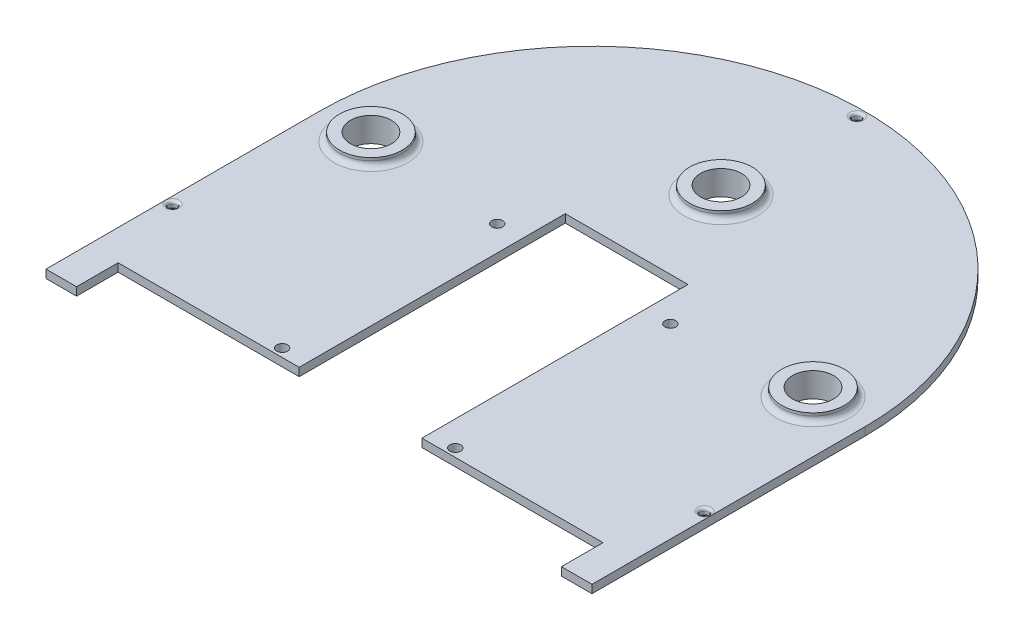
ISO-10303-21;
HEADER;
FILE_DESCRIPTION(('STEP AP214'),'2;1');
FILE_NAME('part.step','',(''),(''),'','','');
FILE_SCHEMA(('AUTOMOTIVE_DESIGN { 1 0 10303 214 1 1 1 1 }'));
ENDSEC;
DATA;
#1=APPLICATION_CONTEXT('core data for automotive mechanical design processes');
#2=APPLICATION_PROTOCOL_DEFINITION('international standard','automotive_design',2000,#1);
#3=PRODUCT_CONTEXT('',#1,'mechanical');
#4=PRODUCT('Part','Part','',(#3));
#5=PRODUCT_RELATED_PRODUCT_CATEGORY('part','',(#4));
#6=PRODUCT_DEFINITION_FORMATION('','',#4);
#7=PRODUCT_DEFINITION_CONTEXT('part definition',#1,'design');
#8=PRODUCT_DEFINITION('design','',#6,#7);
#9=PRODUCT_DEFINITION_SHAPE('','',#8);
#10=(LENGTH_UNIT() NAMED_UNIT(*) SI_UNIT(.MILLI.,.METRE.));
#11=(NAMED_UNIT(*) PLANE_ANGLE_UNIT() SI_UNIT($,.RADIAN.));
#12=(NAMED_UNIT(*) SI_UNIT($,.STERADIAN.) SOLID_ANGLE_UNIT());
#13=UNCERTAINTY_MEASURE_WITH_UNIT(LENGTH_MEASURE(1.E-05),#10,'distance_accuracy_value','');
#14=(GEOMETRIC_REPRESENTATION_CONTEXT(3) GLOBAL_UNCERTAINTY_ASSIGNED_CONTEXT((#13)) GLOBAL_UNIT_ASSIGNED_CONTEXT((#10,
#11,#12)) REPRESENTATION_CONTEXT('',''));
#15=CARTESIAN_POINT('',(0.,0.,0.));
#16=DIRECTION('',(0.,0.,1.));
#17=DIRECTION('',(1.,0.,0.));
#18=AXIS2_PLACEMENT_3D('',#15,#16,#17);
#19=CARTESIAN_POINT('',(-88.9,0.,84.86));
#20=DIRECTION('',(0.,0.,-1.));
#21=DIRECTION('',(-1.,0.,0.));
#22=AXIS2_PLACEMENT_3D('',#19,#20,#21);
#23=PLANE('',#22);
#24=DIRECTION('',(-1.,0.,0.));
#25=VECTOR('',#24,1.);
#26=CARTESIAN_POINT('',(-88.9,0.,84.86));
#27=LINE('',#26,#25);
#28=CARTESIAN_POINT('',(-22.5,0.,84.86));
#29=VERTEX_POINT('',#28);
#30=CARTESIAN_POINT('',(-88.9,0.,84.86));
#31=VERTEX_POINT('',#30);
#32=EDGE_CURVE('E249',#29,#31,#27,.T.);
#33=ORIENTED_EDGE('',*,*,#32,.F.);
#34=DIRECTION('',(0.,1.,0.));
#35=VECTOR('',#34,1.);
#36=CARTESIAN_POINT('',(-22.5,0.,84.86));
#37=LINE('',#36,#35);
#38=CARTESIAN_POINT('',(-22.5,3.,84.86));
#39=VERTEX_POINT('',#38);
#40=EDGE_CURVE('E371',#29,#39,#37,.T.);
#41=ORIENTED_EDGE('',*,*,#40,.T.);
#42=DIRECTION('',(-1.,0.,0.));
#43=VECTOR('',#42,1.);
#44=CARTESIAN_POINT('',(-88.9,3.,84.86));
#45=LINE('',#44,#43);
#46=CARTESIAN_POINT('',(-88.9,3.,84.86));
#47=VERTEX_POINT('',#46);
#48=EDGE_CURVE('E259',#39,#47,#45,.T.);
#49=ORIENTED_EDGE('',*,*,#48,.T.);
#50=DIRECTION('',(0.,1.,0.));
#51=VECTOR('',#50,1.);
#52=CARTESIAN_POINT('',(-88.9,0.,84.86));
#53=LINE('',#52,#51);
#54=EDGE_CURVE('E262',#31,#47,#53,.T.);
#55=ORIENTED_EDGE('',*,*,#54,.F.);
#56=EDGE_LOOP('',(#33,#41,#49,#55));
#57=FACE_BOUND('',#56,.T.);
#58=ADVANCED_FACE('F47',(#57),#23,.F.);
#59=CARTESIAN_POINT('',(0.,3.,100.1));
#60=DIRECTION('',(0.,0.,-1.));
#61=DIRECTION('',(-1.,0.,0.));
#62=AXIS2_PLACEMENT_3D('',#59,#60,#61);
#63=PLANE('',#62);
#64=DIRECTION('',(1.,0.,0.));
#65=VECTOR('',#64,1.);
#66=CARTESIAN_POINT('',(0.,0.,100.1));
#67=LINE('',#66,#65);
#68=CARTESIAN_POINT('',(-100.1,0.,100.1));
#69=VERTEX_POINT('',#68);
#70=CARTESIAN_POINT('',(-88.9,0.,100.1));
#71=VERTEX_POINT('',#70);
#72=EDGE_CURVE('E300',#69,#71,#67,.T.);
#73=ORIENTED_EDGE('',*,*,#72,.T.);
#74=DIRECTION('',(0.,1.,0.));
#75=VECTOR('',#74,1.);
#76=CARTESIAN_POINT('',(-88.9,0.,100.1));
#77=LINE('',#76,#75);
#78=CARTESIAN_POINT('',(-88.9,3.,100.1));
#79=VERTEX_POINT('',#78);
#80=EDGE_CURVE('E252',#71,#79,#77,.T.);
#81=ORIENTED_EDGE('',*,*,#80,.T.);
#82=DIRECTION('',(1.,0.,0.));
#83=VECTOR('',#82,1.);
#84=CARTESIAN_POINT('',(0.,3.,100.1));
#85=LINE('',#84,#83);
#86=CARTESIAN_POINT('',(-100.1,3.,100.1));
#87=VERTEX_POINT('',#86);
#88=EDGE_CURVE('E285',#87,#79,#85,.T.);
#89=ORIENTED_EDGE('',*,*,#88,.F.);
#90=DIRECTION('',(0.,-1.,0.));
#91=VECTOR('',#90,1.);
#92=CARTESIAN_POINT('',(-100.1,3.,100.1));
#93=LINE('',#92,#91);
#94=EDGE_CURVE('E313',#87,#69,#93,.T.);
#95=ORIENTED_EDGE('',*,*,#94,.T.);
#96=EDGE_LOOP('',(#73,#81,#89,#95));
#97=FACE_BOUND('',#96,.T.);
#98=ADVANCED_FACE('F489',(#97),#63,.F.);
#99=CARTESIAN_POINT('',(0.,3.,0.));
#100=DIRECTION('',(0.,-1.,0.));
#101=DIRECTION('',(0.,0.,-1.));
#102=AXIS2_PLACEMENT_3D('',#99,#100,#101);
#103=CYLINDRICAL_SURFACE('',#102,100.1);
#104=CARTESIAN_POINT('',(0.,0.,0.));
#105=DIRECTION('',(0.,1.,0.));
#106=DIRECTION('',(0.,0.,1.));
#107=AXIS2_PLACEMENT_3D('',#104,#105,#106);
#108=CIRCLE('',#107,100.1);
#109=CARTESIAN_POINT('',(100.1,0.,0.));
#110=VERTEX_POINT('',#109);
#111=CARTESIAN_POINT('',(-100.1,0.,0.));
#112=VERTEX_POINT('',#111);
#113=EDGE_CURVE('E266',#110,#112,#108,.T.);
#114=ORIENTED_EDGE('',*,*,#113,.T.);
#115=DIRECTION('',(0.,-1.,0.));
#116=VECTOR('',#115,1.);
#117=CARTESIAN_POINT('',(-100.1,3.,0.));
#118=LINE('',#117,#116);
#119=CARTESIAN_POINT('',(-100.1,3.,0.));
#120=VERTEX_POINT('',#119);
#121=EDGE_CURVE('E317',#120,#112,#118,.T.);
#122=ORIENTED_EDGE('',*,*,#121,.F.);
#123=CARTESIAN_POINT('',(0.,3.,0.));
#124=DIRECTION('',(0.,1.,0.));
#125=DIRECTION('',(0.,0.,1.));
#126=AXIS2_PLACEMENT_3D('',#123,#124,#125);
#127=CIRCLE('',#126,100.1);
#128=CARTESIAN_POINT('',(100.1,3.,0.));
#129=VERTEX_POINT('',#128);
#130=EDGE_CURVE('E276',#129,#120,#127,.T.);
#131=ORIENTED_EDGE('',*,*,#130,.F.);
#132=DIRECTION('',(0.,-1.,0.));
#133=VECTOR('',#132,1.);
#134=CARTESIAN_POINT('',(100.1,3.,0.));
#135=LINE('',#134,#133);
#136=EDGE_CURVE('E292',#129,#110,#135,.T.);
#137=ORIENTED_EDGE('',*,*,#136,.T.);
#138=EDGE_LOOP('',(#114,#122,#131,#137));
#139=FACE_BOUND('',#138,.T.);
#140=ADVANCED_FACE('F497',(#139),#103,.T.);
#141=CARTESIAN_POINT('',(-100.1,3.,0.));
#142=DIRECTION('',(1.,0.,0.));
#143=DIRECTION('',(0.,0.,-1.));
#144=AXIS2_PLACEMENT_3D('',#141,#142,#143);
#145=PLANE('',#144);
#146=DIRECTION('',(0.,0.,1.));
#147=VECTOR('',#146,1.);
#148=CARTESIAN_POINT('',(-100.1,0.,0.));
#149=LINE('',#148,#147);
#150=EDGE_CURVE('E296',#112,#69,#149,.T.);
#151=ORIENTED_EDGE('',*,*,#150,.T.);
#152=ORIENTED_EDGE('',*,*,#94,.F.);
#153=DIRECTION('',(0.,0.,1.));
#154=VECTOR('',#153,1.);
#155=CARTESIAN_POINT('',(-100.1,3.,0.));
#156=LINE('',#155,#154);
#157=EDGE_CURVE('E280',#120,#87,#156,.T.);
#158=ORIENTED_EDGE('',*,*,#157,.F.);
#159=ORIENTED_EDGE('',*,*,#121,.T.);
#160=EDGE_LOOP('',(#151,#152,#158,#159));
#161=FACE_BOUND('',#160,.T.);
#162=ADVANCED_FACE('F494',(#161),#145,.F.);
#163=CARTESIAN_POINT('',(88.9,3.,100.1));
#164=VERTEX_POINT('',#163);
#165=CARTESIAN_POINT('',(100.1,3.,100.1));
#166=VERTEX_POINT('',#165);
#167=EDGE_CURVE('E284',#164,#166,#85,.T.);
#168=ORIENTED_EDGE('',*,*,#167,.F.);
#169=DIRECTION('',(0.,1.,0.));
#170=VECTOR('',#169,1.);
#171=CARTESIAN_POINT('',(88.9,0.,100.1));
#172=LINE('',#171,#170);
#173=CARTESIAN_POINT('',(88.9,0.,100.1));
#174=VERTEX_POINT('',#173);
#175=EDGE_CURVE('E270',#174,#164,#172,.T.);
#176=ORIENTED_EDGE('',*,*,#175,.F.);
#177=CARTESIAN_POINT('',(100.1,0.,100.1));
#178=VERTEX_POINT('',#177);
#179=EDGE_CURVE('E299',#174,#178,#67,.T.);
#180=ORIENTED_EDGE('',*,*,#179,.T.);
#181=DIRECTION('',(0.,-1.,0.));
#182=VECTOR('',#181,1.);
#183=CARTESIAN_POINT('',(100.1,3.,100.1));
#184=LINE('',#183,#182);
#185=EDGE_CURVE('E309',#166,#178,#184,.T.);
#186=ORIENTED_EDGE('',*,*,#185,.F.);
#187=EDGE_LOOP('',(#168,#176,#180,#186));
#188=FACE_BOUND('',#187,.T.);
#189=ADVANCED_FACE('F474',(#188),#63,.F.);
#190=CARTESIAN_POINT('',(100.1,3.,0.));
#191=DIRECTION('',(-1.,0.,0.));
#192=DIRECTION('',(0.,0.,1.));
#193=AXIS2_PLACEMENT_3D('',#190,#191,#192);
#194=PLANE('',#193);
#195=DIRECTION('',(0.,0.,-1.));
#196=VECTOR('',#195,1.);
#197=CARTESIAN_POINT('',(100.1,0.,0.));
#198=LINE('',#197,#196);
#199=EDGE_CURVE('E281',#178,#110,#198,.T.);
#200=ORIENTED_EDGE('',*,*,#199,.T.);
#201=ORIENTED_EDGE('',*,*,#136,.F.);
#202=DIRECTION('',(0.,0.,-1.));
#203=VECTOR('',#202,1.);
#204=CARTESIAN_POINT('',(100.1,3.,0.));
#205=LINE('',#204,#203);
#206=EDGE_CURVE('E289',#166,#129,#205,.T.);
#207=ORIENTED_EDGE('',*,*,#206,.F.);
#208=ORIENTED_EDGE('',*,*,#185,.T.);
#209=EDGE_LOOP('',(#200,#201,#207,#208));
#210=FACE_BOUND('',#209,.T.);
#211=ADVANCED_FACE('F500',(#210),#194,.F.);
#212=CARTESIAN_POINT('',(0.,3.,0.));
#213=DIRECTION('',(0.,1.,0.));
#214=DIRECTION('',(0.,0.,1.));
#215=AXIS2_PLACEMENT_3D('',#212,#213,#214);
#216=PLANE('',#215);
#217=DIRECTION('',(0.,0.,1.));
#218=VECTOR('',#217,1.);
#219=CARTESIAN_POINT('',(-22.5,3.,0.));
#220=LINE('',#219,#218);
#221=CARTESIAN_POINT('',(-22.5,3.,-12.7));
#222=VERTEX_POINT('',#221);
#223=EDGE_CURVE('E145',#222,#39,#220,.T.);
#224=ORIENTED_EDGE('',*,*,#223,.F.);
#225=DIRECTION('',(-1.,0.,0.));
#226=VECTOR('',#225,1.);
#227=CARTESIAN_POINT('',(-22.5,3.,-12.7));
#228=LINE('',#227,#226);
#229=CARTESIAN_POINT('',(22.5,3.,-12.7));
#230=VERTEX_POINT('',#229);
#231=EDGE_CURVE('E152',#230,#222,#228,.T.);
#232=ORIENTED_EDGE('',*,*,#231,.F.);
#233=DIRECTION('',(0.,0.,-1.));
#234=VECTOR('',#233,1.);
#235=CARTESIAN_POINT('',(22.5,3.,0.));
#236=LINE('',#235,#234);
#237=CARTESIAN_POINT('',(22.5,3.,84.86));
#238=VERTEX_POINT('',#237);
#239=EDGE_CURVE('E135',#238,#230,#236,.T.);
#240=ORIENTED_EDGE('',*,*,#239,.F.);
#241=CARTESIAN_POINT('',(88.9,3.,84.86));
#242=VERTEX_POINT('',#241);
#243=EDGE_CURVE('E245',#242,#238,#45,.T.);
#244=ORIENTED_EDGE('',*,*,#243,.F.);
#245=DIRECTION('',(0.,0.,-1.));
#246=VECTOR('',#245,1.);
#247=CARTESIAN_POINT('',(88.9,3.,100.1));
#248=LINE('',#247,#246);
#249=EDGE_CURVE('E255',#164,#242,#248,.T.);
#250=ORIENTED_EDGE('',*,*,#249,.F.);
#251=ORIENTED_EDGE('',*,*,#167,.T.);
#252=ORIENTED_EDGE('',*,*,#206,.T.);
#253=ORIENTED_EDGE('',*,*,#130,.T.);
#254=ORIENTED_EDGE('',*,*,#157,.T.);
#255=ORIENTED_EDGE('',*,*,#88,.T.);
#256=DIRECTION('',(0.,0.,1.));
#257=VECTOR('',#256,1.);
#258=CARTESIAN_POINT('',(-88.9,3.,100.1));
#259=LINE('',#258,#257);
#260=EDGE_CURVE('E239',#47,#79,#259,.T.);
#261=ORIENTED_EDGE('',*,*,#260,.F.);
#262=ORIENTED_EDGE('',*,*,#48,.F.);
#263=EDGE_LOOP('',(#224,#232,#240,#244,#250,#251,#252,#253,#254,#255,#261,#262));
#264=FACE_BOUND('',#263,.T.);
#265=CARTESIAN_POINT('',(-97.5019237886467,3.,56.2927619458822));
#266=DIRECTION('',(0.,1.,0.));
#267=DIRECTION('',(0.,0.,1.));
#268=AXIS2_PLACEMENT_3D('',#265,#266,#267);
#269=CIRCLE('',#268,2.5);
#270=CARTESIAN_POINT('',(-97.5019237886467,3.,58.7927619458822));
#271=VERTEX_POINT('',#270);
#272=EDGE_CURVE('E417',#271,#271,#269,.F.);
#273=ORIENTED_EDGE('',*,*,#272,.T.);
#274=EDGE_LOOP('',(#273));
#275=FACE_BOUND('',#274,.T.);
#276=CARTESIAN_POINT('',(97.5019237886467,3.,56.2927619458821));
#277=DIRECTION('',(0.,1.,0.));
#278=DIRECTION('',(0.,0.,1.));
#279=AXIS2_PLACEMENT_3D('',#276,#277,#278);
#280=CIRCLE('',#279,2.5);
#281=CARTESIAN_POINT('',(97.5019237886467,3.,58.7927619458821));
#282=VERTEX_POINT('',#281);
#283=EDGE_CURVE('E413',#282,#282,#280,.F.);
#284=ORIENTED_EDGE('',*,*,#283,.T.);
#285=EDGE_LOOP('',(#284));
#286=FACE_BOUND('',#285,.T.);
#287=CARTESIAN_POINT('',(0.,3.,-97.1));
#288=DIRECTION('',(0.,1.,0.));
#289=DIRECTION('',(0.,0.,1.));
#290=AXIS2_PLACEMENT_3D('',#287,#288,#289);
#291=CIRCLE('',#290,2.5);
#292=CARTESIAN_POINT('',(0.,3.,-94.6));
#293=VERTEX_POINT('',#292);
#294=EDGE_CURVE('E409',#293,#293,#291,.F.);
#295=ORIENTED_EDGE('',*,*,#294,.T.);
#296=EDGE_LOOP('',(#295));
#297=FACE_BOUND('',#296,.T.);
#298=CARTESIAN_POINT('',(31.75,3.,81.86));
#299=DIRECTION('',(0.,1.,0.));
#300=DIRECTION('',(0.,0.,-1.));
#301=AXIS2_PLACEMENT_3D('',#298,#299,#300);
#302=CIRCLE('',#301,2.);
#303=CARTESIAN_POINT('',(31.75,3.,79.86));
#304=VERTEX_POINT('',#303);
#305=EDGE_CURVE('E164',#304,#304,#302,.T.);
#306=ORIENTED_EDGE('',*,*,#305,.F.);
#307=EDGE_LOOP('',(#306));
#308=FACE_BOUND('',#307,.T.);
#309=CARTESIAN_POINT('',(31.75,3.,3.));
#310=DIRECTION('',(0.,1.,0.));
#311=DIRECTION('',(0.,0.,-1.));
#312=AXIS2_PLACEMENT_3D('',#309,#310,#311);
#313=CIRCLE('',#312,2.);
#314=CARTESIAN_POINT('',(31.75,3.,0.999999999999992));
#315=VERTEX_POINT('',#314);
#316=EDGE_CURVE('E171',#315,#315,#313,.T.);
#317=ORIENTED_EDGE('',*,*,#316,.F.);
#318=EDGE_LOOP('',(#317));
#319=FACE_BOUND('',#318,.T.);
#320=CARTESIAN_POINT('',(-31.75,3.,2.99999999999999));
#321=DIRECTION('',(0.,1.,0.));
#322=DIRECTION('',(0.,0.,1.));
#323=AXIS2_PLACEMENT_3D('',#320,#321,#322);
#324=CIRCLE('',#323,2.);
#325=CARTESIAN_POINT('',(-31.75,3.,4.99999999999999));
#326=VERTEX_POINT('',#325);
#327=EDGE_CURVE('E166',#326,#326,#324,.T.);
#328=ORIENTED_EDGE('',*,*,#327,.F.);
#329=EDGE_LOOP('',(#328));
#330=FACE_BOUND('',#329,.T.);
#331=CARTESIAN_POINT('',(-31.75,3.,81.86));
#332=DIRECTION('',(0.,1.,0.));
#333=DIRECTION('',(0.,0.,1.));
#334=AXIS2_PLACEMENT_3D('',#331,#332,#333);
#335=CIRCLE('',#334,2.);
#336=CARTESIAN_POINT('',(-31.75,3.,83.86));
#337=VERTEX_POINT('',#336);
#338=EDGE_CURVE('E170',#337,#337,#335,.T.);
#339=ORIENTED_EDGE('',*,*,#338,.F.);
#340=EDGE_LOOP('',(#339));
#341=FACE_BOUND('',#340,.T.);
#342=CARTESIAN_POINT('',(-81.05,3.,0.));
#343=DIRECTION('',(0.,1.,0.));
#344=DIRECTION('',(0.,0.,1.));
#345=AXIS2_PLACEMENT_3D('',#342,#343,#344);
#346=CIRCLE('',#345,13.5);
#347=CARTESIAN_POINT('',(-81.05,3.,13.5));
#348=VERTEX_POINT('',#347);
#349=EDGE_CURVE('E333',#348,#348,#346,.F.);
#350=ORIENTED_EDGE('',*,*,#349,.T.);
#351=EDGE_LOOP('',(#350));
#352=FACE_BOUND('',#351,.T.);
#353=CARTESIAN_POINT('',(0.,3.,-47.3));
#354=DIRECTION('',(0.,1.,0.));
#355=DIRECTION('',(0.,0.,1.));
#356=AXIS2_PLACEMENT_3D('',#353,#354,#355);
#357=CIRCLE('',#356,13.5);
#358=CARTESIAN_POINT('',(0.,3.,-33.8));
#359=VERTEX_POINT('',#358);
#360=EDGE_CURVE('E329',#359,#359,#357,.F.);
#361=ORIENTED_EDGE('',*,*,#360,.T.);
#362=EDGE_LOOP('',(#361));
#363=FACE_BOUND('',#362,.T.);
#364=CARTESIAN_POINT('',(81.05,3.,0.));
#365=DIRECTION('',(0.,1.,0.));
#366=DIRECTION('',(0.,0.,1.));
#367=AXIS2_PLACEMENT_3D('',#364,#365,#366);
#368=CIRCLE('',#367,13.5);
#369=CARTESIAN_POINT('',(81.05,3.,13.5));
#370=VERTEX_POINT('',#369);
#371=EDGE_CURVE('E325',#370,#370,#368,.F.);
#372=ORIENTED_EDGE('',*,*,#371,.T.);
#373=EDGE_LOOP('',(#372));
#374=FACE_BOUND('',#373,.T.);
#375=ADVANCED_FACE('F156',(#264,#275,#286,#297,#308,#319,#330,#341,#352,#363,#374),#216,.T.);
#376=CARTESIAN_POINT('',(0.,0.,0.));
#377=DIRECTION('',(0.,1.,0.));
#378=DIRECTION('',(0.,0.,1.));
#379=AXIS2_PLACEMENT_3D('',#376,#377,#378);
#380=PLANE('',#379);
#381=CARTESIAN_POINT('',(-97.5019237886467,0.,56.2927619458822));
#382=DIRECTION('',(0.,1.,0.));
#383=DIRECTION('',(0.,0.,1.));
#384=AXIS2_PLACEMENT_3D('',#381,#382,#383);
#385=CIRCLE('',#384,2.5);
#386=CARTESIAN_POINT('',(-97.5019237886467,0.,58.7927619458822));
#387=VERTEX_POINT('',#386);
#388=EDGE_CURVE('E397',#387,#387,#385,.T.);
#389=ORIENTED_EDGE('',*,*,#388,.T.);
#390=EDGE_LOOP('',(#389));
#391=FACE_BOUND('',#390,.T.);
#392=CARTESIAN_POINT('',(97.5019237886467,0.,56.2927619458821));
#393=DIRECTION('',(0.,1.,0.));
#394=DIRECTION('',(0.,0.,1.));
#395=AXIS2_PLACEMENT_3D('',#392,#393,#394);
#396=CIRCLE('',#395,2.5);
#397=CARTESIAN_POINT('',(97.5019237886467,0.,58.7927619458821));
#398=VERTEX_POINT('',#397);
#399=EDGE_CURVE('E393',#398,#398,#396,.T.);
#400=ORIENTED_EDGE('',*,*,#399,.T.);
#401=EDGE_LOOP('',(#400));
#402=FACE_BOUND('',#401,.T.);
#403=CARTESIAN_POINT('',(0.,0.,-97.1));
#404=DIRECTION('',(0.,1.,0.));
#405=DIRECTION('',(0.,0.,1.));
#406=AXIS2_PLACEMENT_3D('',#403,#404,#405);
#407=CIRCLE('',#406,2.5);
#408=CARTESIAN_POINT('',(0.,0.,-94.6));
#409=VERTEX_POINT('',#408);
#410=EDGE_CURVE('E375',#409,#409,#407,.T.);
#411=ORIENTED_EDGE('',*,*,#410,.T.);
#412=EDGE_LOOP('',(#411));
#413=FACE_BOUND('',#412,.T.);
#414=CARTESIAN_POINT('',(31.75,0.,81.86));
#415=DIRECTION('',(0.,1.,0.));
#416=DIRECTION('',(0.,0.,1.));
#417=AXIS2_PLACEMENT_3D('',#414,#415,#416);
#418=CIRCLE('',#417,2.);
#419=CARTESIAN_POINT('',(31.75,0.,83.86));
#420=VERTEX_POINT('',#419);
#421=EDGE_CURVE('E183',#420,#420,#418,.T.);
#422=ORIENTED_EDGE('',*,*,#421,.T.);
#423=EDGE_LOOP('',(#422));
#424=FACE_BOUND('',#423,.T.);
#425=CARTESIAN_POINT('',(31.75,0.,3.));
#426=DIRECTION('',(0.,1.,0.));
#427=DIRECTION('',(0.,0.,1.));
#428=AXIS2_PLACEMENT_3D('',#425,#426,#427);
#429=CIRCLE('',#428,2.);
#430=CARTESIAN_POINT('',(31.75,0.,5.));
#431=VERTEX_POINT('',#430);
#432=EDGE_CURVE('E383',#431,#431,#429,.T.);
#433=ORIENTED_EDGE('',*,*,#432,.T.);
#434=EDGE_LOOP('',(#433));
#435=FACE_BOUND('',#434,.T.);
#436=CARTESIAN_POINT('',(-31.75,0.,2.99999999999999));
#437=DIRECTION('',(0.,1.,0.));
#438=DIRECTION('',(0.,0.,1.));
#439=AXIS2_PLACEMENT_3D('',#436,#437,#438);
#440=CIRCLE('',#439,2.);
#441=CARTESIAN_POINT('',(-31.75,0.,4.99999999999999));
#442=VERTEX_POINT('',#441);
#443=EDGE_CURVE('E379',#442,#442,#440,.T.);
#444=ORIENTED_EDGE('',*,*,#443,.T.);
#445=EDGE_LOOP('',(#444));
#446=FACE_BOUND('',#445,.T.);
#447=CARTESIAN_POINT('',(-31.75,0.,81.86));
#448=DIRECTION('',(0.,1.,0.));
#449=DIRECTION('',(0.,0.,1.));
#450=AXIS2_PLACEMENT_3D('',#447,#448,#449);
#451=CIRCLE('',#450,2.);
#452=CARTESIAN_POINT('',(-31.75,0.,83.86));
#453=VERTEX_POINT('',#452);
#454=EDGE_CURVE('E181',#453,#453,#451,.T.);
#455=ORIENTED_EDGE('',*,*,#454,.T.);
#456=EDGE_LOOP('',(#455));
#457=FACE_BOUND('',#456,.T.);
#458=CARTESIAN_POINT('',(81.05,0.,0.));
#459=DIRECTION('',(0.,1.,0.));
#460=DIRECTION('',(0.,0.,1.));
#461=AXIS2_PLACEMENT_3D('',#458,#459,#460);
#462=CIRCLE('',#461,13.5);
#463=CARTESIAN_POINT('',(81.05,0.,13.5));
#464=VERTEX_POINT('',#463);
#465=EDGE_CURVE('E353',#464,#464,#462,.T.);
#466=ORIENTED_EDGE('',*,*,#465,.T.);
#467=EDGE_LOOP('',(#466));
#468=FACE_BOUND('',#467,.T.);
#469=CARTESIAN_POINT('',(0.,0.,-47.3));
#470=DIRECTION('',(0.,1.,0.));
#471=DIRECTION('',(0.,0.,1.));
#472=AXIS2_PLACEMENT_3D('',#469,#470,#471);
#473=CIRCLE('',#472,13.5);
#474=CARTESIAN_POINT('',(0.,0.,-33.8));
#475=VERTEX_POINT('',#474);
#476=EDGE_CURVE('E349',#475,#475,#473,.T.);
#477=ORIENTED_EDGE('',*,*,#476,.T.);
#478=EDGE_LOOP('',(#477));
#479=FACE_BOUND('',#478,.T.);
#480=CARTESIAN_POINT('',(-81.05,0.,0.));
#481=DIRECTION('',(0.,1.,0.));
#482=DIRECTION('',(0.,0.,1.));
#483=AXIS2_PLACEMENT_3D('',#480,#481,#482);
#484=CIRCLE('',#483,13.5);
#485=CARTESIAN_POINT('',(-81.05,0.,13.5));
#486=VERTEX_POINT('',#485);
#487=EDGE_CURVE('E345',#486,#486,#484,.T.);
#488=ORIENTED_EDGE('',*,*,#487,.T.);
#489=EDGE_LOOP('',(#488));
#490=FACE_BOUND('',#489,.T.);
#491=DIRECTION('',(-1.,0.,0.));
#492=VECTOR('',#491,1.);
#493=CARTESIAN_POINT('',(0.,0.,-12.7));
#494=LINE('',#493,#492);
#495=CARTESIAN_POINT('',(22.5,0.,-12.7));
#496=VERTEX_POINT('',#495);
#497=CARTESIAN_POINT('',(-22.5,0.,-12.7));
#498=VERTEX_POINT('',#497);
#499=EDGE_CURVE('E11',#496,#498,#494,.T.);
#500=ORIENTED_EDGE('',*,*,#499,.T.);
#501=DIRECTION('',(0.,0.,1.));
#502=VECTOR('',#501,1.);
#503=CARTESIAN_POINT('',(-22.5,0.,0.));
#504=LINE('',#503,#502);
#505=EDGE_CURVE('E187',#498,#29,#504,.T.);
#506=ORIENTED_EDGE('',*,*,#505,.T.);
#507=ORIENTED_EDGE('',*,*,#32,.T.);
#508=DIRECTION('',(0.,0.,1.));
#509=VECTOR('',#508,1.);
#510=CARTESIAN_POINT('',(-88.9,0.,100.1));
#511=LINE('',#510,#509);
#512=EDGE_CURVE('E240',#31,#71,#511,.T.);
#513=ORIENTED_EDGE('',*,*,#512,.T.);
#514=ORIENTED_EDGE('',*,*,#72,.F.);
#515=ORIENTED_EDGE('',*,*,#150,.F.);
#516=ORIENTED_EDGE('',*,*,#113,.F.);
#517=ORIENTED_EDGE('',*,*,#199,.F.);
#518=ORIENTED_EDGE('',*,*,#179,.F.);
#519=DIRECTION('',(0.,0.,-1.));
#520=VECTOR('',#519,1.);
#521=CARTESIAN_POINT('',(88.9,0.,100.1));
#522=LINE('',#521,#520);
#523=CARTESIAN_POINT('',(88.9,0.,84.86));
#524=VERTEX_POINT('',#523);
#525=EDGE_CURVE('E244',#174,#524,#522,.T.);
#526=ORIENTED_EDGE('',*,*,#525,.T.);
#527=CARTESIAN_POINT('',(22.5,0.,84.86));
#528=VERTEX_POINT('',#527);
#529=EDGE_CURVE('E70',#524,#528,#27,.T.);
#530=ORIENTED_EDGE('',*,*,#529,.T.);
#531=DIRECTION('',(0.,0.,-1.));
#532=VECTOR('',#531,1.);
#533=CARTESIAN_POINT('',(22.5,0.,0.));
#534=LINE('',#533,#532);
#535=EDGE_CURVE('E63',#528,#496,#534,.T.);
#536=ORIENTED_EDGE('',*,*,#535,.T.);
#537=EDGE_LOOP('',(#500,#506,#507,#513,#514,#515,#516,#517,#518,#526,#530,#536));
#538=FACE_BOUND('',#537,.T.);
#539=ADVANCED_FACE('F445',(#391,#402,#413,#424,#435,#446,#457,#468,#479,#490,#538),#380,.F.);
#540=CARTESIAN_POINT('',(-88.9,0.,100.1));
#541=DIRECTION('',(-1.,0.,0.));
#542=DIRECTION('',(0.,0.,1.));
#543=AXIS2_PLACEMENT_3D('',#540,#541,#542);
#544=PLANE('',#543);
#545=ORIENTED_EDGE('',*,*,#260,.T.);
#546=ORIENTED_EDGE('',*,*,#80,.F.);
#547=ORIENTED_EDGE('',*,*,#512,.F.);
#548=ORIENTED_EDGE('',*,*,#54,.T.);
#549=EDGE_LOOP('',(#545,#546,#547,#548));
#550=FACE_BOUND('',#549,.T.);
#551=ADVANCED_FACE('F448',(#550),#544,.F.);
#552=ORIENTED_EDGE('',*,*,#243,.T.);
#553=DIRECTION('',(0.,-1.,0.));
#554=VECTOR('',#553,1.);
#555=CARTESIAN_POINT('',(22.5,0.,84.86));
#556=LINE('',#555,#554);
#557=EDGE_CURVE('E139',#238,#528,#556,.T.);
#558=ORIENTED_EDGE('',*,*,#557,.T.);
#559=ORIENTED_EDGE('',*,*,#529,.F.);
#560=DIRECTION('',(0.,1.,0.));
#561=VECTOR('',#560,1.);
#562=CARTESIAN_POINT('',(88.9,0.,84.86));
#563=LINE('',#562,#561);
#564=EDGE_CURVE('E267',#524,#242,#563,.T.);
#565=ORIENTED_EDGE('',*,*,#564,.T.);
#566=EDGE_LOOP('',(#552,#558,#559,#565));
#567=FACE_BOUND('',#566,.T.);
#568=ADVANCED_FACE('F513',(#567),#23,.F.);
#569=CARTESIAN_POINT('',(88.9,0.,100.1));
#570=DIRECTION('',(1.,0.,0.));
#571=DIRECTION('',(0.,0.,-1.));
#572=AXIS2_PLACEMENT_3D('',#569,#570,#571);
#573=PLANE('',#572);
#574=ORIENTED_EDGE('',*,*,#249,.T.);
#575=ORIENTED_EDGE('',*,*,#564,.F.);
#576=ORIENTED_EDGE('',*,*,#525,.F.);
#577=ORIENTED_EDGE('',*,*,#175,.T.);
#578=EDGE_LOOP('',(#574,#575,#576,#577));
#579=FACE_BOUND('',#578,.T.);
#580=ADVANCED_FACE('F470',(#579),#573,.F.);
#581=CARTESIAN_POINT('',(0.,-3.,-47.3));
#582=DIRECTION('',(0.,1.,0.));
#583=DIRECTION('',(0.,0.,1.));
#584=AXIS2_PLACEMENT_3D('',#581,#582,#583);
#585=CYLINDRICAL_SURFACE('',#584,11.5);
#586=CARTESIAN_POINT('',(0.,-2.,-47.3));
#587=DIRECTION('',(0.,1.,0.));
#588=DIRECTION('',(0.,0.,1.));
#589=AXIS2_PLACEMENT_3D('',#586,#587,#588);
#590=CIRCLE('',#589,11.5);
#591=CARTESIAN_POINT('',(0.,-2.,-35.8));
#592=VERTEX_POINT('',#591);
#593=EDGE_CURVE('E361',#592,#592,#590,.F.);
#594=ORIENTED_EDGE('',*,*,#593,.T.);
#595=EDGE_LOOP('',(#594));
#596=FACE_BOUND('',#595,.T.);
#597=CARTESIAN_POINT('',(0.,-3.,-47.3));
#598=DIRECTION('',(0.,1.,0.));
#599=DIRECTION('',(0.,0.,1.));
#600=AXIS2_PLACEMENT_3D('',#597,#598,#599);
#601=CIRCLE('',#600,11.5);
#602=CARTESIAN_POINT('',(0.,-3.,-35.8));
#603=VERTEX_POINT('',#602);
#604=EDGE_CURVE('E235',#603,#603,#601,.T.);
#605=ORIENTED_EDGE('',*,*,#604,.T.);
#606=EDGE_LOOP('',(#605));
#607=FACE_BOUND('',#606,.T.);
#608=ADVANCED_FACE('F524',(#596,#607),#585,.T.);
#609=CARTESIAN_POINT('',(0.,-3.,-47.3));
#610=DIRECTION('',(0.,1.,0.));
#611=DIRECTION('',(0.,0.,1.));
#612=AXIS2_PLACEMENT_3D('',#609,#610,#611);
#613=PLANE('',#612);
#614=CARTESIAN_POINT('',(0.,-3.,-47.3));
#615=DIRECTION('',(0.,1.,0.));
#616=DIRECTION('',(0.,0.,1.));
#617=AXIS2_PLACEMENT_3D('',#614,#615,#616);
#618=CIRCLE('',#617,7.5);
#619=CARTESIAN_POINT('',(0.,-3.,-39.8));
#620=VERTEX_POINT('',#619);
#621=EDGE_CURVE('E231',#620,#620,#618,.T.);
#622=ORIENTED_EDGE('',*,*,#621,.T.);
#623=EDGE_LOOP('',(#622));
#624=FACE_BOUND('',#623,.T.);
#625=ORIENTED_EDGE('',*,*,#604,.F.);
#626=EDGE_LOOP('',(#625));
#627=FACE_BOUND('',#626,.T.);
#628=ADVANCED_FACE('F542',(#624,#627),#613,.F.);
#629=CARTESIAN_POINT('',(0.,0.,-47.3));
#630=DIRECTION('',(0.,1.,0.));
#631=DIRECTION('',(0.,0.,1.));
#632=AXIS2_PLACEMENT_3D('',#629,#630,#631);
#633=CYLINDRICAL_SURFACE('',#632,7.5);
#634=ORIENTED_EDGE('',*,*,#621,.F.);
#635=EDGE_LOOP('',(#634));
#636=FACE_BOUND('',#635,.T.);
#637=CARTESIAN_POINT('',(0.,6.,-47.3));
#638=DIRECTION('',(0.,1.,0.));
#639=DIRECTION('',(0.,0.,1.));
#640=AXIS2_PLACEMENT_3D('',#637,#638,#639);
#641=CIRCLE('',#640,7.5);
#642=CARTESIAN_POINT('',(0.,6.,-39.8));
#643=VERTEX_POINT('',#642);
#644=EDGE_CURVE('E223',#643,#643,#641,.T.);
#645=ORIENTED_EDGE('',*,*,#644,.T.);
#646=EDGE_LOOP('',(#645));
#647=FACE_BOUND('',#646,.T.);
#648=ADVANCED_FACE('F546',(#636,#647),#633,.F.);
#649=CARTESIAN_POINT('',(0.,5.,-47.3));
#650=DIRECTION('',(0.,1.,0.));
#651=DIRECTION('',(0.,0.,1.));
#652=AXIS2_PLACEMENT_3D('',#649,#650,#651);
#653=CIRCLE('',#652,11.5);
#654=CARTESIAN_POINT('',(0.,5.,-35.8));
#655=VERTEX_POINT('',#654);
#656=EDGE_CURVE('E337',#655,#655,#653,.T.);
#657=ORIENTED_EDGE('',*,*,#656,.T.);
#658=EDGE_LOOP('',(#657));
#659=FACE_BOUND('',#658,.T.);
#660=CARTESIAN_POINT('',(0.,6.,-47.3));
#661=DIRECTION('',(0.,1.,0.));
#662=DIRECTION('',(0.,0.,1.));
#663=AXIS2_PLACEMENT_3D('',#660,#661,#662);
#664=CIRCLE('',#663,11.5);
#665=CARTESIAN_POINT('',(0.,6.,-35.8));
#666=VERTEX_POINT('',#665);
#667=EDGE_CURVE('E227',#666,#666,#664,.T.);
#668=ORIENTED_EDGE('',*,*,#667,.F.);
#669=EDGE_LOOP('',(#668));
#670=FACE_BOUND('',#669,.T.);
#671=ADVANCED_FACE('F556',(#659,#670),#585,.T.);
#672=CARTESIAN_POINT('',(0.,6.,-47.3));
#673=DIRECTION('',(0.,1.,0.));
#674=DIRECTION('',(0.,0.,1.));
#675=AXIS2_PLACEMENT_3D('',#672,#673,#674);
#676=PLANE('',#675);
#677=ORIENTED_EDGE('',*,*,#667,.T.);
#678=EDGE_LOOP('',(#677));
#679=FACE_BOUND('',#678,.T.);
#680=ORIENTED_EDGE('',*,*,#644,.F.);
#681=EDGE_LOOP('',(#680));
#682=FACE_BOUND('',#681,.T.);
#683=ADVANCED_FACE('F561',(#679,#682),#676,.T.);
#684=CARTESIAN_POINT('',(81.05,-3.,0.));
#685=DIRECTION('',(0.,1.,0.));
#686=DIRECTION('',(0.,0.,1.));
#687=AXIS2_PLACEMENT_3D('',#684,#685,#686);
#688=CYLINDRICAL_SURFACE('',#687,11.5);
#689=CARTESIAN_POINT('',(81.05,-2.,0.));
#690=DIRECTION('',(0.,1.,0.));
#691=DIRECTION('',(0.,0.,1.));
#692=AXIS2_PLACEMENT_3D('',#689,#690,#691);
#693=CIRCLE('',#692,11.5);
#694=CARTESIAN_POINT('',(81.05,-2.,11.5));
#695=VERTEX_POINT('',#694);
#696=EDGE_CURVE('E357',#695,#695,#693,.F.);
#697=ORIENTED_EDGE('',*,*,#696,.T.);
#698=EDGE_LOOP('',(#697));
#699=FACE_BOUND('',#698,.T.);
#700=CARTESIAN_POINT('',(81.05,-3.,0.));
#701=DIRECTION('',(0.,1.,0.));
#702=DIRECTION('',(0.,0.,1.));
#703=AXIS2_PLACEMENT_3D('',#700,#701,#702);
#704=CIRCLE('',#703,11.5);
#705=CARTESIAN_POINT('',(81.05,-3.,11.5));
#706=VERTEX_POINT('',#705);
#707=EDGE_CURVE('E207',#706,#706,#704,.T.);
#708=ORIENTED_EDGE('',*,*,#707,.T.);
#709=EDGE_LOOP('',(#708));
#710=FACE_BOUND('',#709,.T.);
#711=ADVANCED_FACE('F565',(#699,#710),#688,.T.);
#712=CARTESIAN_POINT('',(81.05,-3.,0.));
#713=DIRECTION('',(0.,1.,0.));
#714=DIRECTION('',(0.,0.,1.));
#715=AXIS2_PLACEMENT_3D('',#712,#713,#714);
#716=PLANE('',#715);
#717=CARTESIAN_POINT('',(81.05,-3.,0.));
#718=DIRECTION('',(0.,1.,0.));
#719=DIRECTION('',(0.,0.,1.));
#720=AXIS2_PLACEMENT_3D('',#717,#718,#719);
#721=CIRCLE('',#720,7.5);
#722=CARTESIAN_POINT('',(81.05,-3.,7.5));
#723=VERTEX_POINT('',#722);
#724=EDGE_CURVE('E211',#723,#723,#721,.T.);
#725=ORIENTED_EDGE('',*,*,#724,.T.);
#726=EDGE_LOOP('',(#725));
#727=FACE_BOUND('',#726,.T.);
#728=ORIENTED_EDGE('',*,*,#707,.F.);
#729=EDGE_LOOP('',(#728));
#730=FACE_BOUND('',#729,.T.);
#731=ADVANCED_FACE('F572',(#727,#730),#716,.F.);
#732=CARTESIAN_POINT('',(81.05,0.,0.));
#733=DIRECTION('',(0.,1.,0.));
#734=DIRECTION('',(0.,0.,1.));
#735=AXIS2_PLACEMENT_3D('',#732,#733,#734);
#736=CYLINDRICAL_SURFACE('',#735,7.5);
#737=ORIENTED_EDGE('',*,*,#724,.F.);
#738=EDGE_LOOP('',(#737));
#739=FACE_BOUND('',#738,.T.);
#740=CARTESIAN_POINT('',(81.05,6.,0.));
#741=DIRECTION('',(0.,1.,0.));
#742=DIRECTION('',(0.,0.,1.));
#743=AXIS2_PLACEMENT_3D('',#740,#741,#742);
#744=CIRCLE('',#743,7.5);
#745=CARTESIAN_POINT('',(81.05,6.,7.5));
#746=VERTEX_POINT('',#745);
#747=EDGE_CURVE('E219',#746,#746,#744,.T.);
#748=ORIENTED_EDGE('',*,*,#747,.T.);
#749=EDGE_LOOP('',(#748));
#750=FACE_BOUND('',#749,.T.);
#751=ADVANCED_FACE('F576',(#739,#750),#736,.F.);
#752=CARTESIAN_POINT('',(81.05,5.,0.));
#753=DIRECTION('',(0.,1.,0.));
#754=DIRECTION('',(0.,0.,1.));
#755=AXIS2_PLACEMENT_3D('',#752,#753,#754);
#756=CIRCLE('',#755,11.5);
#757=CARTESIAN_POINT('',(81.05,5.,11.5));
#758=VERTEX_POINT('',#757);
#759=EDGE_CURVE('E341',#758,#758,#756,.T.);
#760=ORIENTED_EDGE('',*,*,#759,.T.);
#761=EDGE_LOOP('',(#760));
#762=FACE_BOUND('',#761,.T.);
#763=CARTESIAN_POINT('',(81.05,6.,0.));
#764=DIRECTION('',(0.,1.,0.));
#765=DIRECTION('',(0.,0.,1.));
#766=AXIS2_PLACEMENT_3D('',#763,#764,#765);
#767=CIRCLE('',#766,11.5);
#768=CARTESIAN_POINT('',(81.05,6.,11.5));
#769=VERTEX_POINT('',#768);
#770=EDGE_CURVE('E215',#769,#769,#767,.T.);
#771=ORIENTED_EDGE('',*,*,#770,.F.);
#772=EDGE_LOOP('',(#771));
#773=FACE_BOUND('',#772,.T.);
#774=ADVANCED_FACE('F585',(#762,#773),#688,.T.);
#775=CARTESIAN_POINT('',(81.05,6.,0.));
#776=DIRECTION('',(0.,1.,0.));
#777=DIRECTION('',(0.,0.,1.));
#778=AXIS2_PLACEMENT_3D('',#775,#776,#777);
#779=PLANE('',#778);
#780=ORIENTED_EDGE('',*,*,#770,.T.);
#781=EDGE_LOOP('',(#780));
#782=FACE_BOUND('',#781,.T.);
#783=ORIENTED_EDGE('',*,*,#747,.F.);
#784=EDGE_LOOP('',(#783));
#785=FACE_BOUND('',#784,.T.);
#786=ADVANCED_FACE('F592',(#782,#785),#779,.T.);
#787=CARTESIAN_POINT('',(-81.05,-3.,0.));
#788=DIRECTION('',(0.,1.,0.));
#789=DIRECTION('',(0.,0.,1.));
#790=AXIS2_PLACEMENT_3D('',#787,#788,#789);
#791=CYLINDRICAL_SURFACE('',#790,11.5);
#792=CARTESIAN_POINT('',(-81.05,-2.,0.));
#793=DIRECTION('',(0.,1.,0.));
#794=DIRECTION('',(0.,0.,1.));
#795=AXIS2_PLACEMENT_3D('',#792,#793,#794);
#796=CIRCLE('',#795,11.5);
#797=CARTESIAN_POINT('',(-81.05,-2.,11.5));
#798=VERTEX_POINT('',#797);
#799=EDGE_CURVE('E365',#798,#798,#796,.F.);
#800=ORIENTED_EDGE('',*,*,#799,.T.);
#801=EDGE_LOOP('',(#800));
#802=FACE_BOUND('',#801,.T.);
#803=CARTESIAN_POINT('',(-81.05,-3.,0.));
#804=DIRECTION('',(0.,1.,0.));
#805=DIRECTION('',(0.,0.,1.));
#806=AXIS2_PLACEMENT_3D('',#803,#804,#805);
#807=CIRCLE('',#806,11.5);
#808=CARTESIAN_POINT('',(-81.05,-3.,11.5));
#809=VERTEX_POINT('',#808);
#810=EDGE_CURVE('E191',#809,#809,#807,.T.);
#811=ORIENTED_EDGE('',*,*,#810,.T.);
#812=EDGE_LOOP('',(#811));
#813=FACE_BOUND('',#812,.T.);
#814=ADVANCED_FACE('F596',(#802,#813),#791,.T.);
#815=CARTESIAN_POINT('',(-81.05,-3.,0.));
#816=DIRECTION('',(0.,1.,0.));
#817=DIRECTION('',(0.,0.,1.));
#818=AXIS2_PLACEMENT_3D('',#815,#816,#817);
#819=PLANE('',#818);
#820=CARTESIAN_POINT('',(-81.05,-3.,0.));
#821=DIRECTION('',(0.,1.,0.));
#822=DIRECTION('',(0.,0.,1.));
#823=AXIS2_PLACEMENT_3D('',#820,#821,#822);
#824=CIRCLE('',#823,7.5);
#825=CARTESIAN_POINT('',(-81.05,-3.,7.50000000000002));
#826=VERTEX_POINT('',#825);
#827=EDGE_CURVE('E195',#826,#826,#824,.T.);
#828=ORIENTED_EDGE('',*,*,#827,.T.);
#829=EDGE_LOOP('',(#828));
#830=FACE_BOUND('',#829,.T.);
#831=ORIENTED_EDGE('',*,*,#810,.F.);
#832=EDGE_LOOP('',(#831));
#833=FACE_BOUND('',#832,.T.);
#834=ADVANCED_FACE('F603',(#830,#833),#819,.F.);
#835=CARTESIAN_POINT('',(-81.05,0.,0.));
#836=DIRECTION('',(0.,1.,0.));
#837=DIRECTION('',(0.,0.,1.));
#838=AXIS2_PLACEMENT_3D('',#835,#836,#837);
#839=CYLINDRICAL_SURFACE('',#838,7.5);
#840=ORIENTED_EDGE('',*,*,#827,.F.);
#841=EDGE_LOOP('',(#840));
#842=FACE_BOUND('',#841,.T.);
#843=CARTESIAN_POINT('',(-81.05,6.,0.));
#844=DIRECTION('',(0.,1.,0.));
#845=DIRECTION('',(0.,0.,1.));
#846=AXIS2_PLACEMENT_3D('',#843,#844,#845);
#847=CIRCLE('',#846,7.5);
#848=CARTESIAN_POINT('',(-81.05,6.,7.50000000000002));
#849=VERTEX_POINT('',#848);
#850=EDGE_CURVE('E203',#849,#849,#847,.T.);
#851=ORIENTED_EDGE('',*,*,#850,.T.);
#852=EDGE_LOOP('',(#851));
#853=FACE_BOUND('',#852,.T.);
#854=ADVANCED_FACE('F607',(#842,#853),#839,.F.);
#855=CARTESIAN_POINT('',(-81.05,5.,0.));
#856=DIRECTION('',(0.,1.,0.));
#857=DIRECTION('',(0.,0.,1.));
#858=AXIS2_PLACEMENT_3D('',#855,#856,#857);
#859=CIRCLE('',#858,11.5);
#860=CARTESIAN_POINT('',(-81.05,5.,11.5));
#861=VERTEX_POINT('',#860);
#862=EDGE_CURVE('E321',#861,#861,#859,.T.);
#863=ORIENTED_EDGE('',*,*,#862,.T.);
#864=EDGE_LOOP('',(#863));
#865=FACE_BOUND('',#864,.T.);
#866=CARTESIAN_POINT('',(-81.05,6.,0.));
#867=DIRECTION('',(0.,1.,0.));
#868=DIRECTION('',(0.,0.,1.));
#869=AXIS2_PLACEMENT_3D('',#866,#867,#868);
#870=CIRCLE('',#869,11.5);
#871=CARTESIAN_POINT('',(-81.05,6.,11.5));
#872=VERTEX_POINT('',#871);
#873=EDGE_CURVE('E199',#872,#872,#870,.T.);
#874=ORIENTED_EDGE('',*,*,#873,.F.);
#875=EDGE_LOOP('',(#874));
#876=FACE_BOUND('',#875,.T.);
#877=ADVANCED_FACE('F616',(#865,#876),#791,.T.);
#878=CARTESIAN_POINT('',(-81.05,6.,0.));
#879=DIRECTION('',(0.,1.,0.));
#880=DIRECTION('',(0.,0.,1.));
#881=AXIS2_PLACEMENT_3D('',#878,#879,#880);
#882=PLANE('',#881);
#883=ORIENTED_EDGE('',*,*,#873,.T.);
#884=EDGE_LOOP('',(#883));
#885=FACE_BOUND('',#884,.T.);
#886=ORIENTED_EDGE('',*,*,#850,.F.);
#887=EDGE_LOOP('',(#886));
#888=FACE_BOUND('',#887,.T.);
#889=ADVANCED_FACE('F623',(#885,#888),#882,.T.);
#890=CARTESIAN_POINT('',(-81.05,5.,0.));
#891=DIRECTION('',(0.,1.,0.));
#892=DIRECTION('',(0.,0.,1.));
#893=AXIS2_PLACEMENT_3D('',#890,#891,#892);
#894=TOROIDAL_SURFACE('',#893,13.5,2.);
#895=ORIENTED_EDGE('',*,*,#349,.F.);
#896=EDGE_LOOP('',(#895));
#897=FACE_BOUND('',#896,.T.);
#898=ORIENTED_EDGE('',*,*,#862,.F.);
#899=EDGE_LOOP('',(#898));
#900=FACE_BOUND('',#899,.T.);
#901=ADVANCED_FACE('F627',(#897,#900),#894,.F.);
#902=CARTESIAN_POINT('',(0.,5.,-47.3));
#903=DIRECTION('',(0.,1.,0.));
#904=DIRECTION('',(0.,0.,1.));
#905=AXIS2_PLACEMENT_3D('',#902,#903,#904);
#906=TOROIDAL_SURFACE('',#905,13.5,2.);
#907=ORIENTED_EDGE('',*,*,#360,.F.);
#908=EDGE_LOOP('',(#907));
#909=FACE_BOUND('',#908,.T.);
#910=ORIENTED_EDGE('',*,*,#656,.F.);
#911=EDGE_LOOP('',(#910));
#912=FACE_BOUND('',#911,.T.);
#913=ADVANCED_FACE('F675',(#909,#912),#906,.F.);
#914=CARTESIAN_POINT('',(81.05,5.,0.));
#915=DIRECTION('',(0.,1.,0.));
#916=DIRECTION('',(0.,0.,1.));
#917=AXIS2_PLACEMENT_3D('',#914,#915,#916);
#918=TOROIDAL_SURFACE('',#917,13.5,2.);
#919=ORIENTED_EDGE('',*,*,#371,.F.);
#920=EDGE_LOOP('',(#919));
#921=FACE_BOUND('',#920,.T.);
#922=ORIENTED_EDGE('',*,*,#759,.F.);
#923=EDGE_LOOP('',(#922));
#924=FACE_BOUND('',#923,.T.);
#925=ADVANCED_FACE('F684',(#921,#924),#918,.F.);
#926=CARTESIAN_POINT('',(81.05,-2.,0.));
#927=DIRECTION('',(0.,1.,0.));
#928=DIRECTION('',(0.,0.,1.));
#929=AXIS2_PLACEMENT_3D('',#926,#927,#928);
#930=TOROIDAL_SURFACE('',#929,13.5,2.);
#931=ORIENTED_EDGE('',*,*,#696,.F.);
#932=EDGE_LOOP('',(#931));
#933=FACE_BOUND('',#932,.T.);
#934=ORIENTED_EDGE('',*,*,#465,.F.);
#935=EDGE_LOOP('',(#934));
#936=FACE_BOUND('',#935,.T.);
#937=ADVANCED_FACE('F693',(#933,#936),#930,.F.);
#938=CARTESIAN_POINT('',(0.,-2.,-47.3));
#939=DIRECTION('',(0.,1.,0.));
#940=DIRECTION('',(0.,0.,1.));
#941=AXIS2_PLACEMENT_3D('',#938,#939,#940);
#942=TOROIDAL_SURFACE('',#941,13.5,2.);
#943=ORIENTED_EDGE('',*,*,#593,.F.);
#944=EDGE_LOOP('',(#943));
#945=FACE_BOUND('',#944,.T.);
#946=ORIENTED_EDGE('',*,*,#476,.F.);
#947=EDGE_LOOP('',(#946));
#948=FACE_BOUND('',#947,.T.);
#949=ADVANCED_FACE('F702',(#945,#948),#942,.F.);
#950=CARTESIAN_POINT('',(-81.05,-2.,0.));
#951=DIRECTION('',(0.,1.,0.));
#952=DIRECTION('',(0.,0.,1.));
#953=AXIS2_PLACEMENT_3D('',#950,#951,#952);
#954=TOROIDAL_SURFACE('',#953,13.5,2.);
#955=ORIENTED_EDGE('',*,*,#799,.F.);
#956=EDGE_LOOP('',(#955));
#957=FACE_BOUND('',#956,.T.);
#958=ORIENTED_EDGE('',*,*,#487,.F.);
#959=EDGE_LOOP('',(#958));
#960=FACE_BOUND('',#959,.T.);
#961=ADVANCED_FACE('F710',(#957,#960),#954,.F.);
#962=CARTESIAN_POINT('',(-22.5,-3.,0.));
#963=DIRECTION('',(-1.,0.,0.));
#964=DIRECTION('',(0.,0.,1.));
#965=AXIS2_PLACEMENT_3D('',#962,#963,#964);
#966=PLANE('',#965);
#967=ORIENTED_EDGE('',*,*,#505,.F.);
#968=DIRECTION('',(0.,1.,0.));
#969=VECTOR('',#968,1.);
#970=CARTESIAN_POINT('',(-22.5,-3.,-12.7));
#971=LINE('',#970,#969);
#972=EDGE_CURVE('E154',#498,#222,#971,.T.);
#973=ORIENTED_EDGE('',*,*,#972,.T.);
#974=ORIENTED_EDGE('',*,*,#223,.T.);
#975=ORIENTED_EDGE('',*,*,#40,.F.);
#976=EDGE_LOOP('',(#967,#973,#974,#975));
#977=FACE_BOUND('',#976,.T.);
#978=ADVANCED_FACE('F718',(#977),#966,.F.);
#979=CARTESIAN_POINT('',(22.5,-3.,0.));
#980=DIRECTION('',(1.,0.,0.));
#981=DIRECTION('',(0.,0.,-1.));
#982=AXIS2_PLACEMENT_3D('',#979,#980,#981);
#983=PLANE('',#982);
#984=ORIENTED_EDGE('',*,*,#557,.F.);
#985=ORIENTED_EDGE('',*,*,#239,.T.);
#986=DIRECTION('',(0.,1.,0.));
#987=VECTOR('',#986,1.);
#988=CARTESIAN_POINT('',(22.5,-3.,-12.7));
#989=LINE('',#988,#987);
#990=EDGE_CURVE('E138',#496,#230,#989,.T.);
#991=ORIENTED_EDGE('',*,*,#990,.F.);
#992=ORIENTED_EDGE('',*,*,#535,.F.);
#993=EDGE_LOOP('',(#984,#985,#991,#992));
#994=FACE_BOUND('',#993,.T.);
#995=ADVANCED_FACE('F137',(#994),#983,.F.);
#996=CARTESIAN_POINT('',(-31.75,-3.,81.86));
#997=DIRECTION('',(0.,1.,0.));
#998=DIRECTION('',(0.,0.,1.));
#999=AXIS2_PLACEMENT_3D('',#996,#997,#998);
#1000=CYLINDRICAL_SURFACE('',#999,2.);
#1001=ORIENTED_EDGE('',*,*,#338,.T.);
#1002=EDGE_LOOP('',(#1001));
#1003=FACE_BOUND('',#1002,.T.);
#1004=ORIENTED_EDGE('',*,*,#454,.F.);
#1005=EDGE_LOOP('',(#1004));
#1006=FACE_BOUND('',#1005,.T.);
#1007=ADVANCED_FACE('F748',(#1003,#1006),#1000,.F.);
#1008=CARTESIAN_POINT('',(-31.75,-3.,2.99999999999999));
#1009=DIRECTION('',(0.,1.,0.));
#1010=DIRECTION('',(0.,0.,1.));
#1011=AXIS2_PLACEMENT_3D('',#1008,#1009,#1010);
#1012=CYLINDRICAL_SURFACE('',#1011,2.);
#1013=ORIENTED_EDGE('',*,*,#327,.T.);
#1014=EDGE_LOOP('',(#1013));
#1015=FACE_BOUND('',#1014,.T.);
#1016=ORIENTED_EDGE('',*,*,#443,.F.);
#1017=EDGE_LOOP('',(#1016));
#1018=FACE_BOUND('',#1017,.T.);
#1019=ADVANCED_FACE('F758',(#1015,#1018),#1012,.F.);
#1020=CARTESIAN_POINT('',(31.75,-3.,3.));
#1021=DIRECTION('',(0.,1.,0.));
#1022=DIRECTION('',(0.,0.,1.));
#1023=AXIS2_PLACEMENT_3D('',#1020,#1021,#1022);
#1024=CYLINDRICAL_SURFACE('',#1023,2.);
#1025=ORIENTED_EDGE('',*,*,#316,.T.);
#1026=EDGE_LOOP('',(#1025));
#1027=FACE_BOUND('',#1026,.T.);
#1028=ORIENTED_EDGE('',*,*,#432,.F.);
#1029=EDGE_LOOP('',(#1028));
#1030=FACE_BOUND('',#1029,.T.);
#1031=ADVANCED_FACE('F768',(#1027,#1030),#1024,.F.);
#1032=CARTESIAN_POINT('',(31.75,-3.,81.86));
#1033=DIRECTION('',(0.,1.,0.));
#1034=DIRECTION('',(0.,0.,1.));
#1035=AXIS2_PLACEMENT_3D('',#1032,#1033,#1034);
#1036=CYLINDRICAL_SURFACE('',#1035,2.);
#1037=ORIENTED_EDGE('',*,*,#305,.T.);
#1038=EDGE_LOOP('',(#1037));
#1039=FACE_BOUND('',#1038,.T.);
#1040=ORIENTED_EDGE('',*,*,#421,.F.);
#1041=EDGE_LOOP('',(#1040));
#1042=FACE_BOUND('',#1041,.T.);
#1043=ADVANCED_FACE('F778',(#1039,#1042),#1036,.F.);
#1044=CARTESIAN_POINT('',(-97.5019237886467,-3.,56.2927619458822));
#1045=DIRECTION('',(0.,1.,0.));
#1046=DIRECTION('',(0.,0.,1.));
#1047=AXIS2_PLACEMENT_3D('',#1044,#1045,#1046);
#1048=CYLINDRICAL_SURFACE('',#1047,1.5);
#1049=CARTESIAN_POINT('',(-97.5019237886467,1.,56.2927619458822));
#1050=DIRECTION('',(0.,1.,0.));
#1051=DIRECTION('',(0.,0.,1.));
#1052=AXIS2_PLACEMENT_3D('',#1049,#1050,#1051);
#1053=CIRCLE('',#1052,1.5);
#1054=CARTESIAN_POINT('',(-97.5019237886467,1.,57.7927619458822));
#1055=VERTEX_POINT('',#1054);
#1056=EDGE_CURVE('E405',#1055,#1055,#1053,.F.);
#1057=ORIENTED_EDGE('',*,*,#1056,.T.);
#1058=EDGE_LOOP('',(#1057));
#1059=FACE_BOUND('',#1058,.T.);
#1060=CARTESIAN_POINT('',(-97.5019237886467,2.,56.2927619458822));
#1061=DIRECTION('',(0.,1.,0.));
#1062=DIRECTION('',(0.,0.,1.));
#1063=AXIS2_PLACEMENT_3D('',#1060,#1061,#1062);
#1064=CIRCLE('',#1063,1.5);
#1065=CARTESIAN_POINT('',(-97.5019237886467,2.,57.7927619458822));
#1066=VERTEX_POINT('',#1065);
#1067=EDGE_CURVE('E401',#1066,#1066,#1064,.T.);
#1068=ORIENTED_EDGE('',*,*,#1067,.T.);
#1069=EDGE_LOOP('',(#1068));
#1070=FACE_BOUND('',#1069,.T.);
#1071=ADVANCED_FACE('F788',(#1059,#1070),#1048,.F.);
#1072=CARTESIAN_POINT('',(97.5019237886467,-3.,56.2927619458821));
#1073=DIRECTION('',(0.,1.,0.));
#1074=DIRECTION('',(0.,0.,1.));
#1075=AXIS2_PLACEMENT_3D('',#1072,#1073,#1074);
#1076=CYLINDRICAL_SURFACE('',#1075,1.5);
#1077=CARTESIAN_POINT('',(97.5019237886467,1.,56.2927619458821));
#1078=DIRECTION('',(0.,1.,0.));
#1079=DIRECTION('',(0.,0.,1.));
#1080=AXIS2_PLACEMENT_3D('',#1077,#1078,#1079);
#1081=CIRCLE('',#1080,1.5);
#1082=CARTESIAN_POINT('',(97.5019237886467,1.,57.7927619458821));
#1083=VERTEX_POINT('',#1082);
#1084=EDGE_CURVE('E425',#1083,#1083,#1081,.F.);
#1085=ORIENTED_EDGE('',*,*,#1084,.T.);
#1086=EDGE_LOOP('',(#1085));
#1087=FACE_BOUND('',#1086,.T.);
#1088=CARTESIAN_POINT('',(97.5019237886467,2.,56.2927619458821));
#1089=DIRECTION('',(0.,1.,0.));
#1090=DIRECTION('',(0.,0.,1.));
#1091=AXIS2_PLACEMENT_3D('',#1088,#1089,#1090);
#1092=CIRCLE('',#1091,1.5);
#1093=CARTESIAN_POINT('',(97.5019237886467,2.,57.7927619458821));
#1094=VERTEX_POINT('',#1093);
#1095=EDGE_CURVE('E421',#1094,#1094,#1092,.T.);
#1096=ORIENTED_EDGE('',*,*,#1095,.T.);
#1097=EDGE_LOOP('',(#1096));
#1098=FACE_BOUND('',#1097,.T.);
#1099=ADVANCED_FACE('F798',(#1087,#1098),#1076,.F.);
#1100=CARTESIAN_POINT('',(0.,-3.,-97.1));
#1101=DIRECTION('',(0.,1.,0.));
#1102=DIRECTION('',(0.,0.,1.));
#1103=AXIS2_PLACEMENT_3D('',#1100,#1101,#1102);
#1104=CYLINDRICAL_SURFACE('',#1103,1.5);
#1105=CARTESIAN_POINT('',(0.,1.,-97.1));
#1106=DIRECTION('',(0.,1.,0.));
#1107=DIRECTION('',(0.,0.,1.));
#1108=AXIS2_PLACEMENT_3D('',#1105,#1106,#1107);
#1109=CIRCLE('',#1108,1.5);
#1110=CARTESIAN_POINT('',(0.,1.,-95.6));
#1111=VERTEX_POINT('',#1110);
#1112=EDGE_CURVE('E56',#1111,#1111,#1109,.F.);
#1113=ORIENTED_EDGE('',*,*,#1112,.T.);
#1114=EDGE_LOOP('',(#1113));
#1115=FACE_BOUND('',#1114,.T.);
#1116=CARTESIAN_POINT('',(0.,2.,-97.1));
#1117=DIRECTION('',(0.,1.,0.));
#1118=DIRECTION('',(0.,0.,1.));
#1119=AXIS2_PLACEMENT_3D('',#1116,#1117,#1118);
#1120=CIRCLE('',#1119,1.5);
#1121=CARTESIAN_POINT('',(0.,2.,-95.6));
#1122=VERTEX_POINT('',#1121);
#1123=EDGE_CURVE('E429',#1122,#1122,#1120,.T.);
#1124=ORIENTED_EDGE('',*,*,#1123,.T.);
#1125=EDGE_LOOP('',(#1124));
#1126=FACE_BOUND('',#1125,.T.);
#1127=ADVANCED_FACE('F436',(#1115,#1126),#1104,.F.);
#1128=CARTESIAN_POINT('',(-97.5019237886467,1.,56.2927619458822));
#1129=DIRECTION('',(0.,1.,0.));
#1130=DIRECTION('',(0.,0.,1.));
#1131=AXIS2_PLACEMENT_3D('',#1128,#1129,#1130);
#1132=TOROIDAL_SURFACE('',#1131,2.5,1.);
#1133=ORIENTED_EDGE('',*,*,#1056,.F.);
#1134=EDGE_LOOP('',(#1133));
#1135=FACE_BOUND('',#1134,.T.);
#1136=ORIENTED_EDGE('',*,*,#388,.F.);
#1137=EDGE_LOOP('',(#1136));
#1138=FACE_BOUND('',#1137,.T.);
#1139=ADVANCED_FACE('F817',(#1135,#1138),#1132,.T.);
#1140=CARTESIAN_POINT('',(-97.5019237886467,2.,56.2927619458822));
#1141=DIRECTION('',(0.,1.,0.));
#1142=DIRECTION('',(0.,0.,1.));
#1143=AXIS2_PLACEMENT_3D('',#1140,#1141,#1142);
#1144=TOROIDAL_SURFACE('',#1143,2.5,1.);
#1145=ORIENTED_EDGE('',*,*,#272,.F.);
#1146=EDGE_LOOP('',(#1145));
#1147=FACE_BOUND('',#1146,.T.);
#1148=ORIENTED_EDGE('',*,*,#1067,.F.);
#1149=EDGE_LOOP('',(#1148));
#1150=FACE_BOUND('',#1149,.T.);
#1151=ADVANCED_FACE('F826',(#1147,#1150),#1144,.T.);
#1152=CARTESIAN_POINT('',(97.5019237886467,1.,56.2927619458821));
#1153=DIRECTION('',(0.,1.,0.));
#1154=DIRECTION('',(0.,0.,1.));
#1155=AXIS2_PLACEMENT_3D('',#1152,#1153,#1154);
#1156=TOROIDAL_SURFACE('',#1155,2.5,1.);
#1157=ORIENTED_EDGE('',*,*,#1084,.F.);
#1158=EDGE_LOOP('',(#1157));
#1159=FACE_BOUND('',#1158,.T.);
#1160=ORIENTED_EDGE('',*,*,#399,.F.);
#1161=EDGE_LOOP('',(#1160));
#1162=FACE_BOUND('',#1161,.T.);
#1163=ADVANCED_FACE('F836',(#1159,#1162),#1156,.T.);
#1164=CARTESIAN_POINT('',(97.5019237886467,2.,56.2927619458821));
#1165=DIRECTION('',(0.,1.,0.));
#1166=DIRECTION('',(0.,0.,1.));
#1167=AXIS2_PLACEMENT_3D('',#1164,#1165,#1166);
#1168=TOROIDAL_SURFACE('',#1167,2.5,1.);
#1169=ORIENTED_EDGE('',*,*,#283,.F.);
#1170=EDGE_LOOP('',(#1169));
#1171=FACE_BOUND('',#1170,.T.);
#1172=ORIENTED_EDGE('',*,*,#1095,.F.);
#1173=EDGE_LOOP('',(#1172));
#1174=FACE_BOUND('',#1173,.T.);
#1175=ADVANCED_FACE('F442',(#1171,#1174),#1168,.T.);
#1176=CARTESIAN_POINT('',(0.,1.,-97.1));
#1177=DIRECTION('',(0.,1.,0.));
#1178=DIRECTION('',(0.,0.,1.));
#1179=AXIS2_PLACEMENT_3D('',#1176,#1177,#1178);
#1180=TOROIDAL_SURFACE('',#1179,2.5,1.);
#1181=ORIENTED_EDGE('',*,*,#1112,.F.);
#1182=EDGE_LOOP('',(#1181));
#1183=FACE_BOUND('',#1182,.T.);
#1184=ORIENTED_EDGE('',*,*,#410,.F.);
#1185=EDGE_LOOP('',(#1184));
#1186=FACE_BOUND('',#1185,.T.);
#1187=ADVANCED_FACE('F439',(#1183,#1186),#1180,.T.);
#1188=CARTESIAN_POINT('',(0.,2.,-97.1));
#1189=DIRECTION('',(0.,1.,0.));
#1190=DIRECTION('',(0.,0.,1.));
#1191=AXIS2_PLACEMENT_3D('',#1188,#1189,#1190);
#1192=TOROIDAL_SURFACE('',#1191,2.5,1.);
#1193=ORIENTED_EDGE('',*,*,#294,.F.);
#1194=EDGE_LOOP('',(#1193));
#1195=FACE_BOUND('',#1194,.T.);
#1196=ORIENTED_EDGE('',*,*,#1123,.F.);
#1197=EDGE_LOOP('',(#1196));
#1198=FACE_BOUND('',#1197,.T.);
#1199=ADVANCED_FACE('F49',(#1195,#1198),#1192,.T.);
#1200=CARTESIAN_POINT('',(-22.5,-3.,-12.7));
#1201=DIRECTION('',(0.,0.,-1.));
#1202=DIRECTION('',(-1.,0.,0.));
#1203=AXIS2_PLACEMENT_3D('',#1200,#1201,#1202);
#1204=PLANE('',#1203);
#1205=ORIENTED_EDGE('',*,*,#990,.T.);
#1206=ORIENTED_EDGE('',*,*,#231,.T.);
#1207=ORIENTED_EDGE('',*,*,#972,.F.);
#1208=ORIENTED_EDGE('',*,*,#499,.F.);
#1209=EDGE_LOOP('',(#1205,#1206,#1207,#1208));
#1210=FACE_BOUND('',#1209,.T.);
#1211=ADVANCED_FACE('F150',(#1210),#1204,.F.);
#1212=CLOSED_SHELL('',(#58,#98,#140,#162,#189,#211,#375,#539,#551,#568,#580,#608,#628,#648,#671,
#683,#711,#731,#751,#774,#786,#814,#834,#854,#877,#889,#901,#913,#925,#937,#949,#961,#978,#995,
#1007,#1019,#1031,#1043,#1071,#1099,#1127,#1139,#1151,#1163,#1175,#1187,#1199,#1211));
#1213=MANIFOLD_SOLID_BREP('B2',#1212);
#1214=ADVANCED_BREP_SHAPE_REPRESENTATION('',(#18,#1213),#14);
#1215=SHAPE_DEFINITION_REPRESENTATION(#9,#1214);
ENDSEC;
END-ISO-10303-21;
